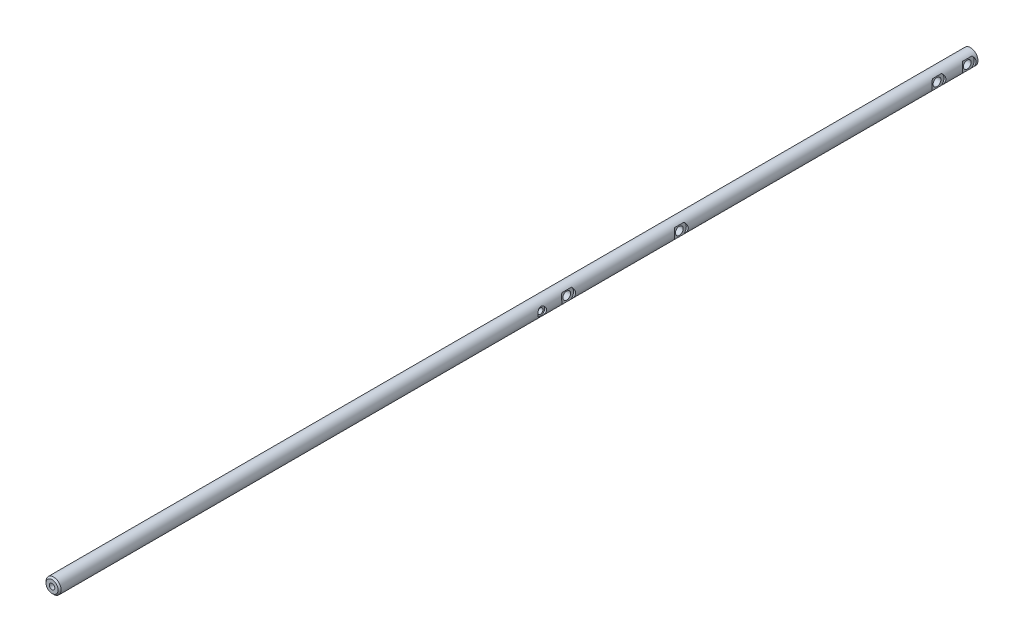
from build123d import *

# Parameters (mm, degrees)
SKETCH1_R                                      = 4.7625
EXTRUDE1_DEPTH                                 = 578.739
CHAMFER1_SIZE                                  = 0.9525
F_8_32_TAPPED_HOLE2_D                          = 3.4544
F_8_32_TAPPED_HOLE2_DEPTH                      = 16.6624
F_8_32_TAPPED_HOLE2_TIP                        = 1.037806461
CBORE_FOR_8_BUTTON_HEAD_CAP_SCREW1_D           = 4.9149
CBORE_FOR_8_BUTTON_HEAD_CAP_SCREW1_CBORE_D     = 8.73252
CBORE_FOR_8_BUTTON_HEAD_CAP_SCREW1_CBORE_DEPTH = 1.27
CBORE_FOR_4_SOCKET_HEAD_CAP_SCREW1_D           = 3.4544
CBORE_FOR_4_SOCKET_HEAD_CAP_SCREW1_CBORE_D     = 5.55752
CBORE_FOR_4_SOCKET_HEAD_CAP_SCREW1_CBORE_DEPTH = 1.27


with BuildPart() as part:
    # Sketch1 → Extrude1 (new body)
    with BuildSketch(Plane.XY):
        Circle(SKETCH1_R)
    extrude(amount=EXTRUDE1_DEPTH)

    # Chamfer1
    chamfer1_edges = [part.edges().sort_by_distance(p)[0] for p in [
        (-4.7625, 0, 578.739),
    ]]
    chamfer(chamfer1_edges, length=CHAMFER1_SIZE)

    # 8-32 Tapped Hole2
    with Locations(Plane.XY.offset(578.739)):
        with Locations((0, 0)):
            Hole(F_8_32_TAPPED_HOLE2_D / 2, depth=F_8_32_TAPPED_HOLE2_DEPTH)
            with Locations((0, 0, -(F_8_32_TAPPED_HOLE2_DEPTH + F_8_32_TAPPED_HOLE2_TIP / 2))):  # 118° drill point
                Cone(0, F_8_32_TAPPED_HOLE2_D / 2, F_8_32_TAPPED_HOLE2_TIP, mode=Mode.SUBTRACT)

    # CBORE for _8 Button Head Cap Screw1 (through all)
    with Locations(Plane(origin=(4.7625, 0, 0), x_dir=(0, 0, -1), z_dir=(1, 0, 0))):
        with Locations((-257.937, 0.14870594), (-186.944, 0), (-24.5745, 0), (-5.5245, 0)):
            CounterBoreHole(CBORE_FOR_8_BUTTON_HEAD_CAP_SCREW1_D / 2, CBORE_FOR_8_BUTTON_HEAD_CAP_SCREW1_CBORE_D / 2, CBORE_FOR_8_BUTTON_HEAD_CAP_SCREW1_CBORE_DEPTH)

    # CBORE for _4 Socket Head Cap Screw1 (through all)
    with Locations(Plane(origin=(4.7625, 0, 0), x_dir=(0, 0, -1), z_dir=(1, 0, 0))):
        with Locations((-274.5994, 0)):
            CounterBoreHole(CBORE_FOR_4_SOCKET_HEAD_CAP_SCREW1_D / 2, CBORE_FOR_4_SOCKET_HEAD_CAP_SCREW1_CBORE_D / 2, CBORE_FOR_4_SOCKET_HEAD_CAP_SCREW1_CBORE_DEPTH)


solid = part.part
